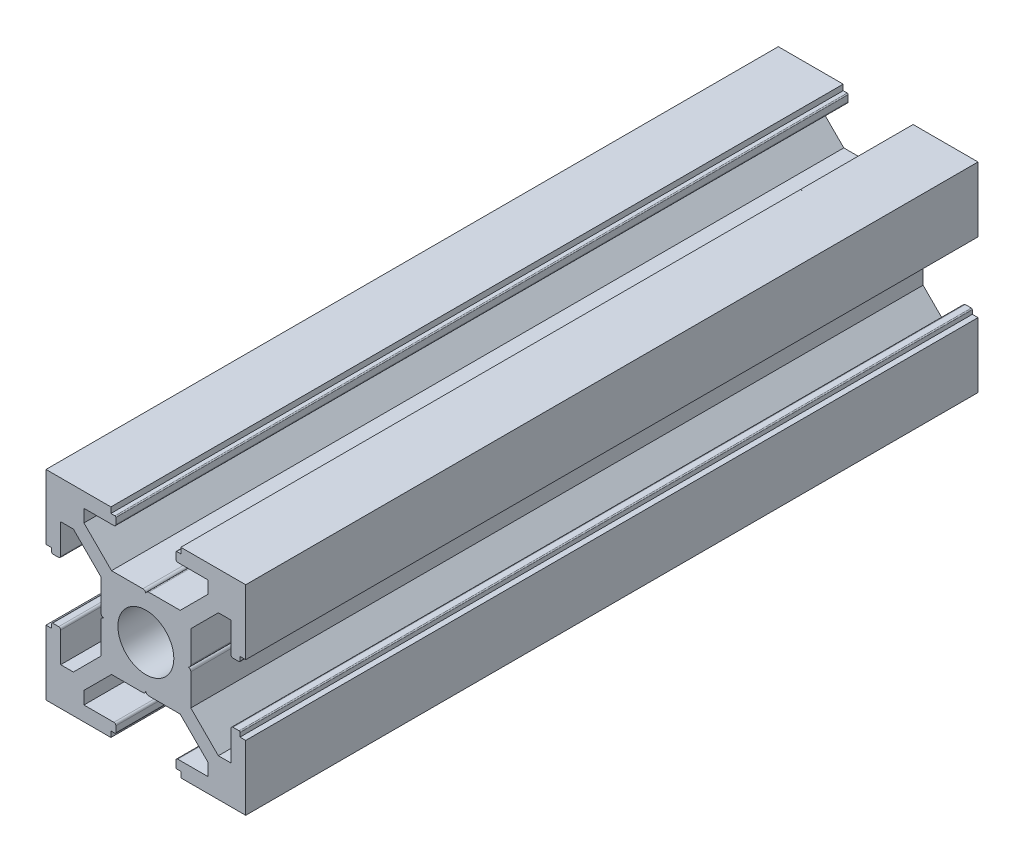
from build123d import *

# Parameters (mm, degrees)
CROQUIS1_R     = 4.2
EXTRUIR1_DEPTH = 110


with BuildPart() as part:
    # Croquis1 → Extruir1 (new body)
    with BuildSketch(Plane.XY):
        with BuildLine():
            Line((-5.25, 15), (-15, 15))
            Line((-15, 15), (-15, 5.25))
            Line((-15, 5.25), (-14.145, 5.25))
            Line((-14.145, 5.25), (-14.145, 4.65))
            ThreePointArc((-14.145, 4.65), (-14.101066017, 4.543933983), (-13.995, 4.5))
            Line((-13.995, 4.5), (-13.095, 4.5))
            ThreePointArc((-13.095, 4.5), (-12.882867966, 4.587867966), (-12.795, 4.8))
            Line((-12.795, 4.8), (-12.795, 9.3))
            Line((-12.795, 9.3), (-10.890990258, 9.3))
            Line((-10.890990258, 9.3), (-8.295495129, 6.704504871))
            Line((-8.295495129, 6.704504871), (-6.75, 5.159009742))
            Line((-6.75, 5.159009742), (-6.75, 0.45))
            ThreePointArc((-6.75, 0.45), (-6.618198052, 0.131801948), (-6.3, 0))
            ThreePointArc((-6.3, 0), (-6.618198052, -0.131801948), (-6.75, -0.45))
            Line((-6.75, -0.45), (-6.75, -5.159009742))
            Line((-6.75, -5.159009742), (-8.295495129, -6.704504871))
            Line((-8.295495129, -6.704504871), (-10.890990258, -9.3))
            Line((-10.890990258, -9.3), (-12.795, -9.3))
            Line((-12.795, -9.3), (-12.795, -4.8))
            ThreePointArc((-12.795, -4.8), (-12.882867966, -4.587867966), (-13.095, -4.5))
            Line((-13.095, -4.5), (-13.995, -4.5))
            ThreePointArc((-13.995, -4.5), (-14.101066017, -4.543933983), (-14.145, -4.65))
            Line((-14.145, -4.65), (-14.145, -5.25))
            Line((-14.145, -5.25), (-15, -5.25))
            Line((-15, -5.25), (-15, -15))
            Line((-15, -15), (-5.25, -15))
            Line((-5.25, -15), (-5.25, -14.145))
            Line((-5.25, -14.145), (-4.65, -14.145))
            ThreePointArc((-4.65, -14.145), (-4.543933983, -14.101066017), (-4.5, -13.995))
            Line((-4.5, -13.995), (-4.5, -13.095))
            ThreePointArc((-4.5, -13.095), (-4.587867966, -12.882867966), (-4.8, -12.795))
            Line((-4.8, -12.795), (-9.3, -12.795))
            Line((-9.3, -12.795), (-9.3, -10.890990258))
            Line((-9.3, -10.890990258), (-6.704504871, -8.295495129))
            Line((-6.704504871, -8.295495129), (-5.159009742, -6.75))
            Line((-5.159009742, -6.75), (-0.45, -6.75))
            ThreePointArc((-0.45, -6.75), (-0.131801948, -6.618198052), (0, -6.3))
            ThreePointArc((0, -6.3), (0.131801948, -6.618198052), (0.45, -6.75))
            Line((0.45, -6.75), (5.159009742, -6.75))
            Line((5.159009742, -6.75), (6.704504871, -8.295495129))
            Line((6.704504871, -8.295495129), (9.3, -10.890990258))
            Line((9.3, -10.890990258), (9.3, -12.795))
            Line((9.3, -12.795), (4.8, -12.795))
            ThreePointArc((4.8, -12.795), (4.587867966, -12.882867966), (4.5, -13.095))
            Line((4.5, -13.095), (4.5, -13.995))
            ThreePointArc((4.5, -13.995), (4.543933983, -14.101066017), (4.65, -14.145))
            Line((4.65, -14.145), (5.25, -14.145))
            Line((5.25, -14.145), (5.25, -15))
            Line((5.25, -15), (15, -15))
            Line((15, -15), (15, -5.25))
            Line((15, -5.25), (14.145, -5.25))
            Line((14.145, -5.25), (14.145, -4.65))
            ThreePointArc((14.145, -4.65), (14.101066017, -4.543933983), (13.995, -4.5))
            Line((13.995, -4.5), (13.095, -4.5))
            ThreePointArc((13.095, -4.5), (12.882867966, -4.587867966), (12.795, -4.8))
            Line((12.795, -4.8), (12.795, -9.3))
            Line((12.795, -9.3), (10.890990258, -9.3))
            Line((10.890990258, -9.3), (8.295495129, -6.704504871))
            Line((8.295495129, -6.704504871), (6.75, -5.159009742))
            Line((6.75, -5.159009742), (6.75, -0.45))
            ThreePointArc((6.75, -0.45), (6.618198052, -0.131801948), (6.3, 0))
            ThreePointArc((6.3, 0), (6.618198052, 0.131801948), (6.75, 0.45))
            Line((6.75, 0.45), (6.75, 5.159009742))
            Line((6.75, 5.159009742), (8.295495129, 6.704504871))
            Line((8.295495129, 6.704504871), (10.890990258, 9.3))
            Line((10.890990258, 9.3), (12.795, 9.3))
            Line((12.795, 9.3), (12.795, 4.8))
            ThreePointArc((12.795, 4.8), (12.882867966, 4.587867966), (13.095, 4.5))
            Line((13.095, 4.5), (13.995, 4.5))
            ThreePointArc((13.995, 4.5), (14.101066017, 4.543933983), (14.145, 4.65))
            Line((14.145, 4.65), (14.145, 5.25))
            Line((14.145, 5.25), (15, 5.25))
            Line((15, 5.25), (15, 15))
            Line((15, 15), (5.25, 15))
            Line((5.25, 15), (5.25, 14.145))
            Line((5.25, 14.145), (4.65, 14.145))
            ThreePointArc((4.65, 14.145), (4.543933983, 14.101066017), (4.5, 13.995))
            Line((4.5, 13.995), (4.5, 13.095))
            ThreePointArc((4.5, 13.095), (4.587867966, 12.882867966), (4.8, 12.795))
            Line((4.8, 12.795), (9.3, 12.795))
            Line((9.3, 12.795), (9.3, 10.890990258))
            Line((9.3, 10.890990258), (6.704504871, 8.295495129))
            Line((6.704504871, 8.295495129), (5.159009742, 6.75))
            Line((5.159009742, 6.75), (0.45, 6.75))
            ThreePointArc((0.45, 6.75), (0.131801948, 6.618198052), (0, 6.3))
            ThreePointArc((0, 6.3), (-0.131801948, 6.618198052), (-0.45, 6.75))
            Line((-0.45, 6.75), (-5.159009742, 6.75))
            Line((-5.159009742, 6.75), (-6.704504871, 8.295495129))
            Line((-6.704504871, 8.295495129), (-9.3, 10.890990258))
            Line((-9.3, 10.890990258), (-9.3, 12.795))
            Line((-9.3, 12.795), (-4.8, 12.795))
            ThreePointArc((-4.8, 12.795), (-4.587867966, 12.882867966), (-4.5, 13.095))
            Line((-4.5, 13.095), (-4.5, 13.995))
            ThreePointArc((-4.5, 13.995), (-4.543933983, 14.101066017), (-4.65, 14.145))
            Line((-4.65, 14.145), (-5.25, 14.145))
            Line((-5.25, 14.145), (-5.25, 15))
        make_face()
        Circle(CROQUIS1_R, mode=Mode.SUBTRACT)
    extrude(amount=EXTRUIR1_DEPTH)


solid = part.part
